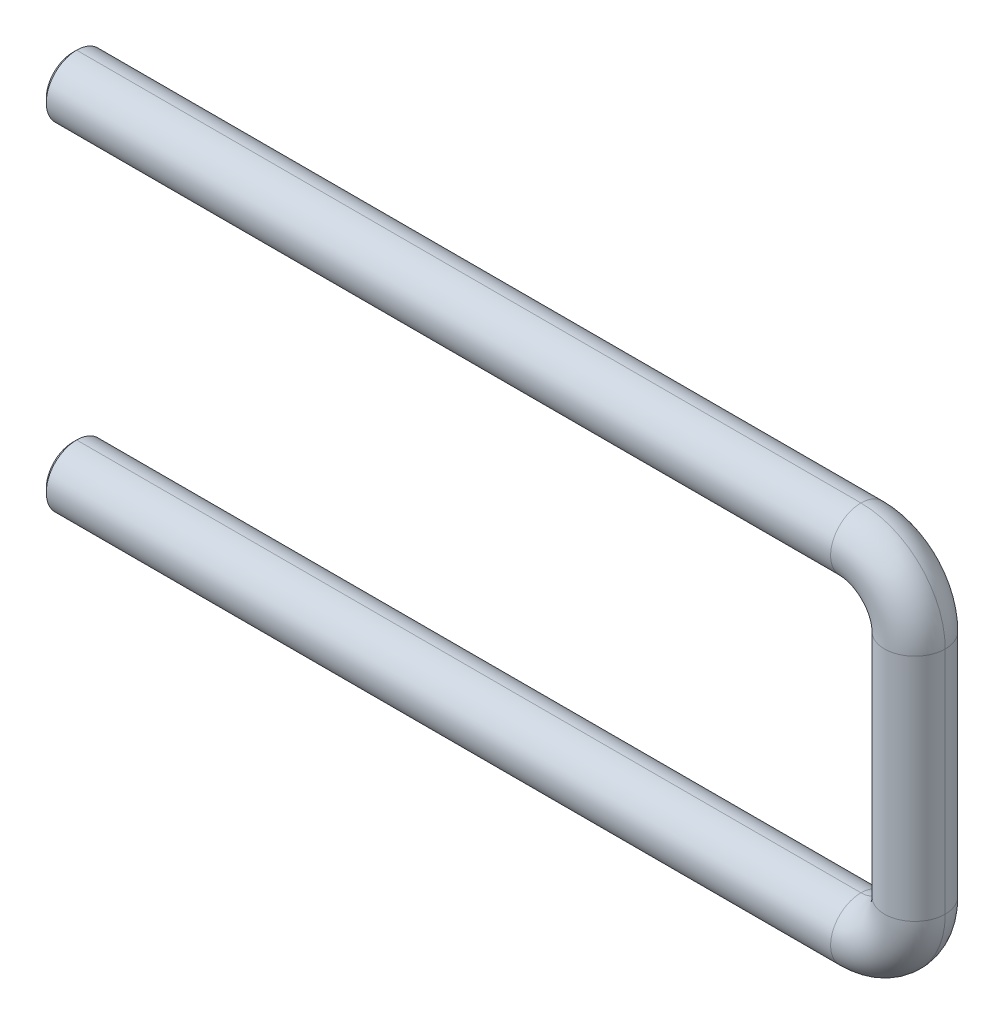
ISO-10303-21;
HEADER;
FILE_DESCRIPTION(('STEP AP214'),'2;1');
FILE_NAME('part.step','',(''),(''),'','','');
FILE_SCHEMA(('AUTOMOTIVE_DESIGN { 1 0 10303 214 1 1 1 1 }'));
ENDSEC;
DATA;
#1=APPLICATION_CONTEXT('core data for automotive mechanical design processes');
#2=APPLICATION_PROTOCOL_DEFINITION('international standard','automotive_design',2000,#1);
#3=PRODUCT_CONTEXT('',#1,'mechanical');
#4=PRODUCT('Part','Part','',(#3));
#5=PRODUCT_RELATED_PRODUCT_CATEGORY('part','',(#4));
#6=PRODUCT_DEFINITION_FORMATION('','',#4);
#7=PRODUCT_DEFINITION_CONTEXT('part definition',#1,'design');
#8=PRODUCT_DEFINITION('design','',#6,#7);
#9=PRODUCT_DEFINITION_SHAPE('','',#8);
#10=(LENGTH_UNIT() NAMED_UNIT(*) SI_UNIT(.MILLI.,.METRE.));
#11=(NAMED_UNIT(*) PLANE_ANGLE_UNIT() SI_UNIT($,.RADIAN.));
#12=(NAMED_UNIT(*) SI_UNIT($,.STERADIAN.) SOLID_ANGLE_UNIT());
#13=UNCERTAINTY_MEASURE_WITH_UNIT(LENGTH_MEASURE(1.E-05),#10,'distance_accuracy_value','');
#14=(GEOMETRIC_REPRESENTATION_CONTEXT(3) GLOBAL_UNCERTAINTY_ASSIGNED_CONTEXT((#13)) GLOBAL_UNIT_ASSIGNED_CONTEXT((#10,
#11,#12)) REPRESENTATION_CONTEXT('',''));
#15=CARTESIAN_POINT('',(0.,0.,0.));
#16=DIRECTION('',(0.,0.,1.));
#17=DIRECTION('',(1.,0.,0.));
#18=AXIS2_PLACEMENT_3D('',#15,#16,#17);
#19=CARTESIAN_POINT('',(-7.112,-15.138,0.));
#20=DIRECTION('',(0.,0.,1.));
#21=DIRECTION('',(1.,0.,0.));
#22=AXIS2_PLACEMENT_3D('',#19,#20,#21);
#23=TOROIDAL_SURFACE('',#22,7.112,4.);
#24=CARTESIAN_POINT('',(-7.112,-22.25,0.));
#25=DIRECTION('',(1.,0.,0.));
#26=DIRECTION('',(0.,1.,0.));
#27=AXIS2_PLACEMENT_3D('',#24,#25,#26);
#28=CIRCLE('',#27,4.);
#29=CARTESIAN_POINT('',(-7.112,-18.25,0.));
#30=VERTEX_POINT('',#29);
#31=CARTESIAN_POINT('',(-7.112,-26.25,0.));
#32=VERTEX_POINT('',#31);
#33=EDGE_CURVE('E9',#30,#32,#28,.T.);
#34=ORIENTED_EDGE('',*,*,#33,.T.);
#35=CARTESIAN_POINT('',(-7.112,-15.138,0.));
#36=DIRECTION('',(0.,0.,1.));
#37=DIRECTION('',(0.,-1.,0.));
#38=AXIS2_PLACEMENT_3D('',#35,#36,#37);
#39=CIRCLE('',#38,11.112);
#40=CARTESIAN_POINT('',(4.,-15.138,0.));
#41=VERTEX_POINT('',#40);
#42=EDGE_CURVE('E25',#32,#41,#39,.T.);
#43=ORIENTED_EDGE('',*,*,#42,.T.);
#44=CARTESIAN_POINT('',(0.,-15.138,0.));
#45=DIRECTION('',(0.,1.,0.));
#46=DIRECTION('',(-1.,0.,0.));
#47=AXIS2_PLACEMENT_3D('',#44,#45,#46);
#48=CIRCLE('',#47,4.);
#49=CARTESIAN_POINT('',(-4.,-15.138,0.));
#50=VERTEX_POINT('',#49);
#51=EDGE_CURVE('E114',#50,#41,#48,.T.);
#52=ORIENTED_EDGE('',*,*,#51,.F.);
#53=CARTESIAN_POINT('',(-7.112,-15.138,0.));
#54=DIRECTION('',(0.,0.,1.));
#55=DIRECTION('',(0.,-1.,0.));
#56=AXIS2_PLACEMENT_3D('',#53,#54,#55);
#57=CIRCLE('',#56,3.112);
#58=EDGE_CURVE('E110',#30,#50,#57,.T.);
#59=ORIENTED_EDGE('',*,*,#58,.F.);
#60=EDGE_LOOP('',(#34,#43,#52,#59));
#61=FACE_BOUND('',#60,.T.);
#62=ADVANCED_FACE('F14',(#61),#23,.T.);
#63=CARTESIAN_POINT('',(-7.112,15.138,0.));
#64=DIRECTION('',(0.,0.,1.));
#65=DIRECTION('',(1.,0.,0.));
#66=AXIS2_PLACEMENT_3D('',#63,#64,#65);
#67=TOROIDAL_SURFACE('',#66,7.112,4.);
#68=CARTESIAN_POINT('',(0.,15.138,0.));
#69=DIRECTION('',(0.,1.,0.));
#70=DIRECTION('',(-1.,0.,0.));
#71=AXIS2_PLACEMENT_3D('',#68,#69,#70);
#72=CIRCLE('',#71,4.);
#73=CARTESIAN_POINT('',(-4.,15.138,0.));
#74=VERTEX_POINT('',#73);
#75=CARTESIAN_POINT('',(4.,15.138,0.));
#76=VERTEX_POINT('',#75);
#77=EDGE_CURVE('E156',#74,#76,#72,.T.);
#78=ORIENTED_EDGE('',*,*,#77,.T.);
#79=CARTESIAN_POINT('',(-7.112,15.138,0.));
#80=DIRECTION('',(0.,0.,1.));
#81=DIRECTION('',(0.,-1.,0.));
#82=AXIS2_PLACEMENT_3D('',#79,#80,#81);
#83=CIRCLE('',#82,11.112);
#84=CARTESIAN_POINT('',(-7.112,26.25,0.));
#85=VERTEX_POINT('',#84);
#86=EDGE_CURVE('E160',#76,#85,#83,.T.);
#87=ORIENTED_EDGE('',*,*,#86,.T.);
#88=CARTESIAN_POINT('',(-7.112,22.25,0.));
#89=DIRECTION('',(-1.,0.,0.));
#90=DIRECTION('',(0.,-1.,0.));
#91=AXIS2_PLACEMENT_3D('',#88,#89,#90);
#92=CIRCLE('',#91,4.);
#93=CARTESIAN_POINT('',(-7.112,18.25,0.));
#94=VERTEX_POINT('',#93);
#95=EDGE_CURVE('E148',#94,#85,#92,.T.);
#96=ORIENTED_EDGE('',*,*,#95,.F.);
#97=CARTESIAN_POINT('',(-7.112,15.138,0.));
#98=DIRECTION('',(0.,0.,1.));
#99=DIRECTION('',(0.,-1.,0.));
#100=AXIS2_PLACEMENT_3D('',#97,#98,#99);
#101=CIRCLE('',#100,3.112);
#102=EDGE_CURVE('E170',#74,#94,#101,.T.);
#103=ORIENTED_EDGE('',*,*,#102,.F.);
#104=EDGE_LOOP('',(#78,#87,#96,#103));
#105=FACE_BOUND('',#104,.T.);
#106=ADVANCED_FACE('F255',(#105),#67,.T.);
#107=CARTESIAN_POINT('',(-110.5,-22.25,0.));
#108=DIRECTION('',(1.,0.,0.));
#109=DIRECTION('',(0.,1.,0.));
#110=AXIS2_PLACEMENT_3D('',#107,#108,#109);
#111=CONICAL_SURFACE('',#110,4.,0.785398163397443);
#112=CARTESIAN_POINT('',(-111.,-22.25,0.));
#113=DIRECTION('',(-1.,0.,0.));
#114=DIRECTION('',(0.,1.,0.));
#115=AXIS2_PLACEMENT_3D('',#112,#113,#114);
#116=CIRCLE('',#115,3.5);
#117=CARTESIAN_POINT('',(-111.,-25.75,0.));
#118=VERTEX_POINT('',#117);
#119=CARTESIAN_POINT('',(-111.,-18.75,0.));
#120=VERTEX_POINT('',#119);
#121=EDGE_CURVE('E152',#118,#120,#116,.T.);
#122=ORIENTED_EDGE('',*,*,#121,.F.);
#123=DIRECTION('',(0.707106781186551,-0.707106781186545,0.));
#124=VECTOR('',#123,1.);
#125=CARTESIAN_POINT('',(-110.5,-26.25,0.));
#126=LINE('',#125,#124);
#127=CARTESIAN_POINT('',(-110.5,-26.25,0.));
#128=VERTEX_POINT('',#127);
#129=EDGE_CURVE('E164',#118,#128,#126,.T.);
#130=ORIENTED_EDGE('',*,*,#129,.T.);
#131=CARTESIAN_POINT('',(-110.5,-22.25,0.));
#132=DIRECTION('',(1.,0.,0.));
#133=DIRECTION('',(0.,1.,0.));
#134=AXIS2_PLACEMENT_3D('',#131,#132,#133);
#135=CIRCLE('',#134,4.);
#136=CARTESIAN_POINT('',(-110.5,-18.25,0.));
#137=VERTEX_POINT('',#136);
#138=EDGE_CURVE('E129',#137,#128,#135,.T.);
#139=ORIENTED_EDGE('',*,*,#138,.F.);
#140=DIRECTION('',(0.707106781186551,0.707106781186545,0.));
#141=VECTOR('',#140,1.);
#142=CARTESIAN_POINT('',(-110.5,-18.25,0.));
#143=LINE('',#142,#141);
#144=EDGE_CURVE('E103',#120,#137,#143,.T.);
#145=ORIENTED_EDGE('',*,*,#144,.F.);
#146=EDGE_LOOP('',(#122,#130,#139,#145));
#147=FACE_BOUND('',#146,.T.);
#148=ADVANCED_FACE('F284',(#147),#111,.T.);
#149=CARTESIAN_POINT('',(-111.,22.25,0.));
#150=DIRECTION('',(1.,0.,0.));
#151=DIRECTION('',(0.,1.,0.));
#152=AXIS2_PLACEMENT_3D('',#149,#150,#151);
#153=CONICAL_SURFACE('',#152,3.5,0.785398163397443);
#154=CARTESIAN_POINT('',(-111.,22.25,0.));
#155=DIRECTION('',(-1.,0.,0.));
#156=DIRECTION('',(0.,-1.,0.));
#157=AXIS2_PLACEMENT_3D('',#154,#155,#156);
#158=CIRCLE('',#157,3.5);
#159=CARTESIAN_POINT('',(-111.,18.75,0.));
#160=VERTEX_POINT('',#159);
#161=CARTESIAN_POINT('',(-111.,25.75,0.));
#162=VERTEX_POINT('',#161);
#163=EDGE_CURVE('E196',#160,#162,#158,.T.);
#164=ORIENTED_EDGE('',*,*,#163,.F.);
#165=DIRECTION('',(0.707106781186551,-0.707106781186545,0.));
#166=VECTOR('',#165,1.);
#167=CARTESIAN_POINT('',(-111.,18.75,0.));
#168=LINE('',#167,#166);
#169=CARTESIAN_POINT('',(-110.5,18.25,0.));
#170=VERTEX_POINT('',#169);
#171=EDGE_CURVE('E128',#160,#170,#168,.T.);
#172=ORIENTED_EDGE('',*,*,#171,.T.);
#173=CARTESIAN_POINT('',(-110.5,22.25,0.));
#174=DIRECTION('',(1.,0.,0.));
#175=DIRECTION('',(0.,-1.,0.));
#176=AXIS2_PLACEMENT_3D('',#173,#174,#175);
#177=CIRCLE('',#176,4.);
#178=CARTESIAN_POINT('',(-110.5,26.25,0.));
#179=VERTEX_POINT('',#178);
#180=EDGE_CURVE('E193',#179,#170,#177,.T.);
#181=ORIENTED_EDGE('',*,*,#180,.F.);
#182=DIRECTION('',(0.707106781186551,0.707106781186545,0.));
#183=VECTOR('',#182,1.);
#184=CARTESIAN_POINT('',(-111.,25.75,0.));
#185=LINE('',#184,#183);
#186=EDGE_CURVE('E149',#162,#179,#185,.T.);
#187=ORIENTED_EDGE('',*,*,#186,.F.);
#188=EDGE_LOOP('',(#164,#172,#181,#187));
#189=FACE_BOUND('',#188,.T.);
#190=ADVANCED_FACE('F262',(#189),#153,.T.);
#191=CARTESIAN_POINT('',(-7.112,-22.25,0.));
#192=DIRECTION('',(-1.,0.,0.));
#193=DIRECTION('',(0.,-1.,0.));
#194=AXIS2_PLACEMENT_3D('',#191,#192,#193);
#195=CYLINDRICAL_SURFACE('',#194,4.);
#196=ORIENTED_EDGE('',*,*,#33,.F.);
#197=DIRECTION('',(-1.,0.,0.));
#198=VECTOR('',#197,1.);
#199=CARTESIAN_POINT('',(-7.112,-18.25,0.));
#200=LINE('',#199,#198);
#201=EDGE_CURVE('E124',#30,#137,#200,.T.);
#202=ORIENTED_EDGE('',*,*,#201,.T.);
#203=ORIENTED_EDGE('',*,*,#138,.T.);
#204=DIRECTION('',(-1.,0.,0.));
#205=VECTOR('',#204,1.);
#206=CARTESIAN_POINT('',(-7.112,-26.25,0.));
#207=LINE('',#206,#205);
#208=EDGE_CURVE('E40',#32,#128,#207,.T.);
#209=ORIENTED_EDGE('',*,*,#208,.F.);
#210=EDGE_LOOP('',(#196,#202,#203,#209));
#211=FACE_BOUND('',#210,.T.);
#212=ADVANCED_FACE('F131',(#211),#195,.T.);
#213=CARTESIAN_POINT('',(0.,-15.138,0.));
#214=DIRECTION('',(0.,1.,0.));
#215=DIRECTION('',(-1.,0.,0.));
#216=AXIS2_PLACEMENT_3D('',#213,#214,#215);
#217=CYLINDRICAL_SURFACE('',#216,4.);
#218=ORIENTED_EDGE('',*,*,#51,.T.);
#219=DIRECTION('',(0.,1.,0.));
#220=VECTOR('',#219,1.);
#221=CARTESIAN_POINT('',(4.,-15.138,0.));
#222=LINE('',#221,#220);
#223=EDGE_CURVE('E145',#41,#76,#222,.T.);
#224=ORIENTED_EDGE('',*,*,#223,.T.);
#225=ORIENTED_EDGE('',*,*,#77,.F.);
#226=DIRECTION('',(0.,1.,0.));
#227=VECTOR('',#226,1.);
#228=CARTESIAN_POINT('',(-4.,-15.138,0.));
#229=LINE('',#228,#227);
#230=EDGE_CURVE('E134',#50,#74,#229,.T.);
#231=ORIENTED_EDGE('',*,*,#230,.F.);
#232=EDGE_LOOP('',(#218,#224,#225,#231));
#233=FACE_BOUND('',#232,.T.);
#234=ADVANCED_FACE('F250',(#233),#217,.T.);
#235=CARTESIAN_POINT('',(-7.112,22.25,0.));
#236=DIRECTION('',(-1.,0.,0.));
#237=DIRECTION('',(0.,-1.,0.));
#238=AXIS2_PLACEMENT_3D('',#235,#236,#237);
#239=CYLINDRICAL_SURFACE('',#238,4.);
#240=ORIENTED_EDGE('',*,*,#95,.T.);
#241=DIRECTION('',(-1.,0.,0.));
#242=VECTOR('',#241,1.);
#243=CARTESIAN_POINT('',(-7.112,26.25,0.));
#244=LINE('',#243,#242);
#245=EDGE_CURVE('E178',#85,#179,#244,.T.);
#246=ORIENTED_EDGE('',*,*,#245,.T.);
#247=ORIENTED_EDGE('',*,*,#180,.T.);
#248=DIRECTION('',(-1.,0.,0.));
#249=VECTOR('',#248,1.);
#250=CARTESIAN_POINT('',(-7.112,18.25,0.));
#251=LINE('',#250,#249);
#252=EDGE_CURVE('E189',#94,#170,#251,.T.);
#253=ORIENTED_EDGE('',*,*,#252,.F.);
#254=EDGE_LOOP('',(#240,#246,#247,#253));
#255=FACE_BOUND('',#254,.T.);
#256=ADVANCED_FACE('F257',(#255),#239,.T.);
#257=CARTESIAN_POINT('',(-7.112,22.25,0.));
#258=DIRECTION('',(-1.,0.,0.));
#259=DIRECTION('',(0.,-1.,0.));
#260=AXIS2_PLACEMENT_3D('',#257,#258,#259);
#261=CYLINDRICAL_SURFACE('',#260,4.);
#262=ORIENTED_EDGE('',*,*,#245,.F.);
#263=CARTESIAN_POINT('',(-7.112,22.25,0.));
#264=DIRECTION('',(-1.,0.,0.));
#265=DIRECTION('',(0.,-1.,0.));
#266=AXIS2_PLACEMENT_3D('',#263,#264,#265);
#267=CIRCLE('',#266,4.);
#268=EDGE_CURVE('E225',#85,#94,#267,.T.);
#269=ORIENTED_EDGE('',*,*,#268,.T.);
#270=ORIENTED_EDGE('',*,*,#252,.T.);
#271=CARTESIAN_POINT('',(-110.5,22.25,0.));
#272=DIRECTION('',(1.,0.,0.));
#273=DIRECTION('',(0.,-1.,0.));
#274=AXIS2_PLACEMENT_3D('',#271,#272,#273);
#275=CIRCLE('',#274,4.);
#276=EDGE_CURVE('E169',#170,#179,#275,.T.);
#277=ORIENTED_EDGE('',*,*,#276,.T.);
#278=EDGE_LOOP('',(#262,#269,#270,#277));
#279=FACE_BOUND('',#278,.T.);
#280=ADVANCED_FACE('F265',(#279),#261,.T.);
#281=CARTESIAN_POINT('',(-7.112,15.138,0.));
#282=DIRECTION('',(0.,0.,1.));
#283=DIRECTION('',(1.,0.,0.));
#284=AXIS2_PLACEMENT_3D('',#281,#282,#283);
#285=TOROIDAL_SURFACE('',#284,7.112,4.);
#286=ORIENTED_EDGE('',*,*,#86,.F.);
#287=CARTESIAN_POINT('',(0.,15.138,0.));
#288=DIRECTION('',(0.,1.,0.));
#289=DIRECTION('',(-1.,0.,0.));
#290=AXIS2_PLACEMENT_3D('',#287,#288,#289);
#291=CIRCLE('',#290,4.);
#292=EDGE_CURVE('E165',#76,#74,#291,.T.);
#293=ORIENTED_EDGE('',*,*,#292,.T.);
#294=ORIENTED_EDGE('',*,*,#102,.T.);
#295=ORIENTED_EDGE('',*,*,#268,.F.);
#296=EDGE_LOOP('',(#286,#293,#294,#295));
#297=FACE_BOUND('',#296,.T.);
#298=ADVANCED_FACE('F253',(#297),#285,.T.);
#299=CARTESIAN_POINT('',(0.,-15.138,0.));
#300=DIRECTION('',(0.,1.,0.));
#301=DIRECTION('',(-1.,0.,0.));
#302=AXIS2_PLACEMENT_3D('',#299,#300,#301);
#303=CYLINDRICAL_SURFACE('',#302,4.);
#304=ORIENTED_EDGE('',*,*,#223,.F.);
#305=CARTESIAN_POINT('',(0.,-15.138,0.));
#306=DIRECTION('',(0.,1.,0.));
#307=DIRECTION('',(-1.,0.,0.));
#308=AXIS2_PLACEMENT_3D('',#305,#306,#307);
#309=CIRCLE('',#308,4.);
#310=EDGE_CURVE('E140',#41,#50,#309,.T.);
#311=ORIENTED_EDGE('',*,*,#310,.T.);
#312=ORIENTED_EDGE('',*,*,#230,.T.);
#313=ORIENTED_EDGE('',*,*,#292,.F.);
#314=EDGE_LOOP('',(#304,#311,#312,#313));
#315=FACE_BOUND('',#314,.T.);
#316=ADVANCED_FACE('F16',(#315),#303,.T.);
#317=CARTESIAN_POINT('',(-7.112,-15.138,0.));
#318=DIRECTION('',(0.,0.,1.));
#319=DIRECTION('',(1.,0.,0.));
#320=AXIS2_PLACEMENT_3D('',#317,#318,#319);
#321=TOROIDAL_SURFACE('',#320,7.112,4.);
#322=ORIENTED_EDGE('',*,*,#42,.F.);
#323=CARTESIAN_POINT('',(-7.112,-22.25,0.));
#324=DIRECTION('',(1.,0.,0.));
#325=DIRECTION('',(0.,1.,0.));
#326=AXIS2_PLACEMENT_3D('',#323,#324,#325);
#327=CIRCLE('',#326,4.);
#328=EDGE_CURVE('E121',#32,#30,#327,.T.);
#329=ORIENTED_EDGE('',*,*,#328,.T.);
#330=ORIENTED_EDGE('',*,*,#58,.T.);
#331=ORIENTED_EDGE('',*,*,#310,.F.);
#332=EDGE_LOOP('',(#322,#329,#330,#331));
#333=FACE_BOUND('',#332,.T.);
#334=ADVANCED_FACE('F132',(#333),#321,.T.);
#335=CARTESIAN_POINT('',(-7.112,-22.25,0.));
#336=DIRECTION('',(-1.,0.,0.));
#337=DIRECTION('',(0.,-1.,0.));
#338=AXIS2_PLACEMENT_3D('',#335,#336,#337);
#339=CYLINDRICAL_SURFACE('',#338,4.);
#340=ORIENTED_EDGE('',*,*,#201,.F.);
#341=ORIENTED_EDGE('',*,*,#328,.F.);
#342=ORIENTED_EDGE('',*,*,#208,.T.);
#343=CARTESIAN_POINT('',(-110.5,-22.25,0.));
#344=DIRECTION('',(1.,0.,0.));
#345=DIRECTION('',(0.,1.,0.));
#346=AXIS2_PLACEMENT_3D('',#343,#344,#345);
#347=CIRCLE('',#346,4.);
#348=EDGE_CURVE('E126',#128,#137,#347,.T.);
#349=ORIENTED_EDGE('',*,*,#348,.T.);
#350=EDGE_LOOP('',(#340,#341,#342,#349));
#351=FACE_BOUND('',#350,.T.);
#352=ADVANCED_FACE('F125',(#351),#339,.T.);
#353=CARTESIAN_POINT('',(-111.,22.25,0.));
#354=DIRECTION('',(-1.,0.,0.));
#355=DIRECTION('',(0.,-1.,0.));
#356=AXIS2_PLACEMENT_3D('',#353,#354,#355);
#357=PLANE('',#356);
#358=CARTESIAN_POINT('',(-111.,22.25,0.));
#359=DIRECTION('',(-1.,0.,0.));
#360=DIRECTION('',(0.,-1.,0.));
#361=AXIS2_PLACEMENT_3D('',#358,#359,#360);
#362=CIRCLE('',#361,3.5);
#363=EDGE_CURVE('E154',#162,#160,#362,.T.);
#364=ORIENTED_EDGE('',*,*,#363,.T.);
#365=ORIENTED_EDGE('',*,*,#163,.T.);
#366=EDGE_LOOP('',(#364,#365));
#367=FACE_BOUND('',#366,.T.);
#368=ADVANCED_FACE('F303',(#367),#357,.T.);
#369=CARTESIAN_POINT('',(-111.,-22.25,0.));
#370=DIRECTION('',(1.,0.,0.));
#371=DIRECTION('',(0.,1.,0.));
#372=AXIS2_PLACEMENT_3D('',#369,#370,#371);
#373=PLANE('',#372);
#374=CARTESIAN_POINT('',(-111.,-22.25,0.));
#375=DIRECTION('',(-1.,0.,0.));
#376=DIRECTION('',(0.,1.,0.));
#377=AXIS2_PLACEMENT_3D('',#374,#375,#376);
#378=CIRCLE('',#377,3.5);
#379=EDGE_CURVE('E18',#120,#118,#378,.T.);
#380=ORIENTED_EDGE('',*,*,#379,.T.);
#381=ORIENTED_EDGE('',*,*,#121,.T.);
#382=EDGE_LOOP('',(#380,#381));
#383=FACE_BOUND('',#382,.T.);
#384=ADVANCED_FACE('F213',(#383),#373,.F.);
#385=CARTESIAN_POINT('',(-111.,22.25,0.));
#386=DIRECTION('',(1.,0.,0.));
#387=DIRECTION('',(0.,1.,0.));
#388=AXIS2_PLACEMENT_3D('',#385,#386,#387);
#389=CONICAL_SURFACE('',#388,3.5,0.785398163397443);
#390=ORIENTED_EDGE('',*,*,#171,.F.);
#391=ORIENTED_EDGE('',*,*,#363,.F.);
#392=ORIENTED_EDGE('',*,*,#186,.T.);
#393=ORIENTED_EDGE('',*,*,#276,.F.);
#394=EDGE_LOOP('',(#390,#391,#392,#393));
#395=FACE_BOUND('',#394,.T.);
#396=ADVANCED_FACE('F264',(#395),#389,.T.);
#397=CARTESIAN_POINT('',(-110.5,-22.25,0.));
#398=DIRECTION('',(1.,0.,0.));
#399=DIRECTION('',(0.,1.,0.));
#400=AXIS2_PLACEMENT_3D('',#397,#398,#399);
#401=CONICAL_SURFACE('',#400,4.,0.785398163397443);
#402=ORIENTED_EDGE('',*,*,#129,.F.);
#403=ORIENTED_EDGE('',*,*,#379,.F.);
#404=ORIENTED_EDGE('',*,*,#144,.T.);
#405=ORIENTED_EDGE('',*,*,#348,.F.);
#406=EDGE_LOOP('',(#402,#403,#404,#405));
#407=FACE_BOUND('',#406,.T.);
#408=ADVANCED_FACE('F215',(#407),#401,.T.);
#409=CLOSED_SHELL('',(#62,#106,#148,#190,#212,#234,#256,#280,#298,#316,#334,#352,#368,#384,#396,#408));
#410=MANIFOLD_SOLID_BREP('B1',#409);
#411=ADVANCED_BREP_SHAPE_REPRESENTATION('',(#18,#410),#14);
#412=SHAPE_DEFINITION_REPRESENTATION(#9,#411);
ENDSEC;
END-ISO-10303-21;
